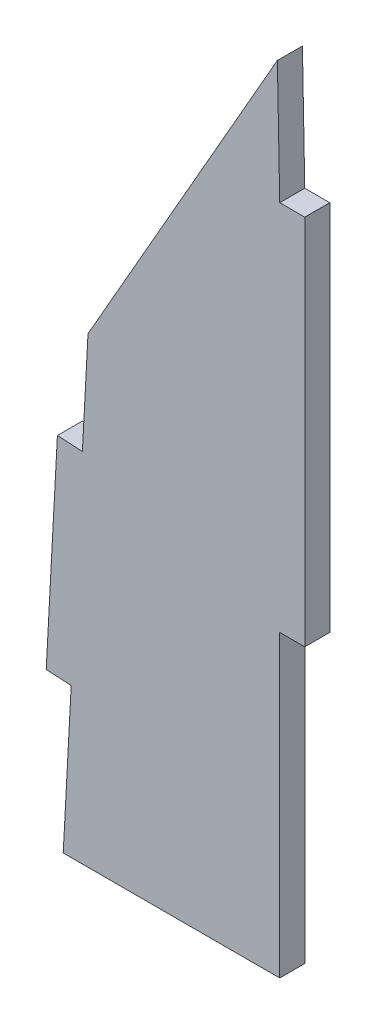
from build123d import *

# Parameters (mm, degrees)
BOSS_EXTRUDE1_DEPTH = 1.524


with BuildPart() as part:
    # Sketch1 → Boss-Extrude1 (new body)
    with BuildSketch(Plane.XY):
        Polygon((0, 38.77004021), (1.524, 38.77004021), (1.524, 16.111089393), (0, 16.111089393), (0, -2.112814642), (-13.183143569, -2.112814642), (-12.696289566, 6.96153897), (-14.218100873, 7.043186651), (-13.537703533, 19.724947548), (-12.015892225, 19.643299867), (-11.673384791, 26.027212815), (-0.142706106, 46.199099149), align=None)
    extrude(amount=BOSS_EXTRUDE1_DEPTH)


solid = part.part
